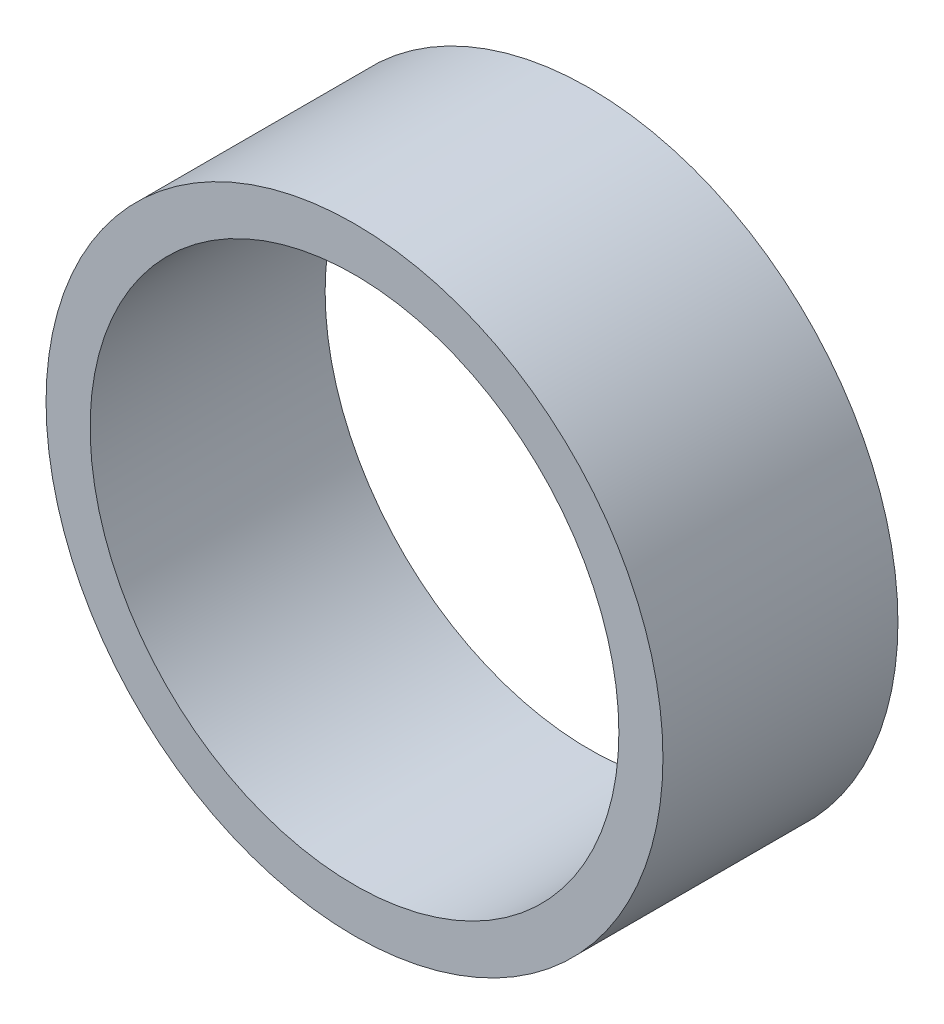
from build123d import *

# Parameters (mm, degrees)
SKETCH_1_R      = 10.5
SKETCH_1_R_2    = 9
EXTRUDE_1_DEPTH = 8


with BuildPart() as part:
    # Sketch 1 → Extrude 1 (new body)
    with BuildSketch(Plane.XY):
        with Locations((4.5, 0)):
            Circle(SKETCH_1_R)
        with Locations((4.5, 0)):
            Circle(SKETCH_1_R_2, mode=Mode.SUBTRACT)
    extrude(amount=-EXTRUDE_1_DEPTH)


solid = part.part
